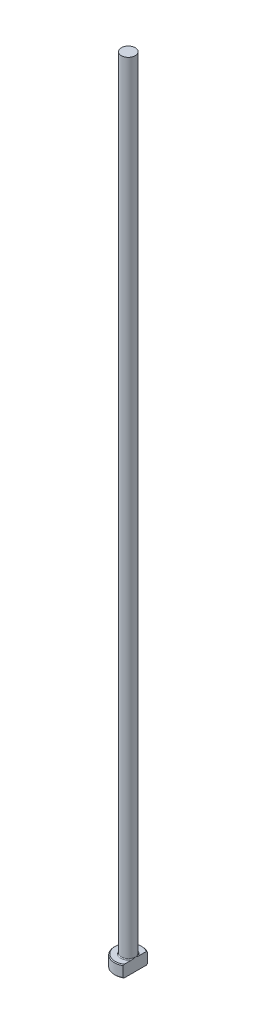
ISO-10303-21;
HEADER;
FILE_DESCRIPTION(('STEP AP214'),'2;1');
FILE_NAME('part.step','',(''),(''),'','','');
FILE_SCHEMA(('AUTOMOTIVE_DESIGN { 1 0 10303 214 1 1 1 1 }'));
ENDSEC;
DATA;
#1=APPLICATION_CONTEXT('core data for automotive mechanical design processes');
#2=APPLICATION_PROTOCOL_DEFINITION('international standard','automotive_design',2000,#1);
#3=PRODUCT_CONTEXT('',#1,'mechanical');
#4=PRODUCT('Part','Part','',(#3));
#5=PRODUCT_RELATED_PRODUCT_CATEGORY('part','',(#4));
#6=PRODUCT_DEFINITION_FORMATION('','',#4);
#7=PRODUCT_DEFINITION_CONTEXT('part definition',#1,'design');
#8=PRODUCT_DEFINITION('design','',#6,#7);
#9=PRODUCT_DEFINITION_SHAPE('','',#8);
#10=(LENGTH_UNIT() NAMED_UNIT(*) SI_UNIT(.MILLI.,.METRE.));
#11=(NAMED_UNIT(*) PLANE_ANGLE_UNIT() SI_UNIT($,.RADIAN.));
#12=(NAMED_UNIT(*) SI_UNIT($,.STERADIAN.) SOLID_ANGLE_UNIT());
#13=UNCERTAINTY_MEASURE_WITH_UNIT(LENGTH_MEASURE(1.E-05),#10,'distance_accuracy_value','');
#14=(GEOMETRIC_REPRESENTATION_CONTEXT(3) GLOBAL_UNCERTAINTY_ASSIGNED_CONTEXT((#13)) GLOBAL_UNIT_ASSIGNED_CONTEXT((#10,
#11,#12)) REPRESENTATION_CONTEXT('',''));
#15=CARTESIAN_POINT('',(0.,0.,0.));
#16=DIRECTION('',(0.,0.,1.));
#17=DIRECTION('',(1.,0.,0.));
#18=AXIS2_PLACEMENT_3D('',#15,#16,#17);
#19=CARTESIAN_POINT('',(0.,0.,0.));
#20=DIRECTION('',(0.,-1.,0.));
#21=DIRECTION('',(0.,0.,-1.));
#22=AXIS2_PLACEMENT_3D('',#19,#20,#21);
#23=PLANE('',#22);
#24=CARTESIAN_POINT('',(0.,0.,0.));
#25=DIRECTION('',(0.,-1.,0.));
#26=DIRECTION('',(0.,0.,-1.));
#27=AXIS2_PLACEMENT_3D('',#24,#25,#26);
#28=CIRCLE('',#27,3.29999999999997);
#29=CARTESIAN_POINT('',(1.74999999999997,0.,2.79776696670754));
#30=VERTEX_POINT('',#29);
#31=CARTESIAN_POINT('',(1.74999999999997,0.,-2.79776696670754));
#32=VERTEX_POINT('',#31);
#33=EDGE_CURVE('E98',#30,#32,#28,.T.);
#34=ORIENTED_EDGE('',*,*,#33,.T.);
#35=DIRECTION('',(0.,0.,1.));
#36=VECTOR('',#35,1.);
#37=CARTESIAN_POINT('',(1.74999999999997,0.,-3.03108891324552));
#38=LINE('',#37,#36);
#39=EDGE_CURVE('E83',#32,#30,#38,.T.);
#40=ORIENTED_EDGE('',*,*,#39,.T.);
#41=EDGE_LOOP('',(#34,#40));
#42=FACE_BOUND('',#41,.T.);
#43=ADVANCED_FACE('F32',(#42),#23,.T.);
#44=CARTESIAN_POINT('',(0.,259.958771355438,0.));
#45=DIRECTION('',(0.,1.,0.));
#46=DIRECTION('',(0.,0.,1.));
#47=AXIS2_PLACEMENT_3D('',#44,#45,#46);
#48=CYLINDRICAL_SURFACE('',#47,3.49999999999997);
#49=CARTESIAN_POINT('',(0.,2.80000000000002,0.));
#50=DIRECTION('',(0.,1.,0.));
#51=DIRECTION('',(0.,0.,1.));
#52=AXIS2_PLACEMENT_3D('',#49,#50,#51);
#53=CIRCLE('',#52,3.49999999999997);
#54=CARTESIAN_POINT('',(1.74999999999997,2.80000000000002,3.03108891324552));
#55=VERTEX_POINT('',#54);
#56=CARTESIAN_POINT('',(1.74999999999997,2.80000000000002,-3.03108891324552));
#57=VERTEX_POINT('',#56);
#58=EDGE_CURVE('E104',#55,#57,#53,.F.);
#59=ORIENTED_EDGE('',*,*,#58,.T.);
#60=DIRECTION('',(0.,-1.,0.));
#61=VECTOR('',#60,1.);
#62=CARTESIAN_POINT('',(1.74999999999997,200.,-3.03108891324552));
#63=LINE('',#62,#61);
#64=CARTESIAN_POINT('',(1.74999999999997,0.199999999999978,-3.03108891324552));
#65=VERTEX_POINT('',#64);
#66=EDGE_CURVE('E183',#57,#65,#63,.T.);
#67=ORIENTED_EDGE('',*,*,#66,.T.);
#68=CARTESIAN_POINT('',(0.,0.199999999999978,0.));
#69=DIRECTION('',(0.,-1.,0.));
#70=DIRECTION('',(0.,0.,-1.));
#71=AXIS2_PLACEMENT_3D('',#68,#69,#70);
#72=CIRCLE('',#71,3.49999999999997);
#73=CARTESIAN_POINT('',(1.74999999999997,0.199999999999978,3.03108891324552));
#74=VERTEX_POINT('',#73);
#75=EDGE_CURVE('E100',#65,#74,#72,.F.);
#76=ORIENTED_EDGE('',*,*,#75,.T.);
#77=DIRECTION('',(0.,-1.,0.));
#78=VECTOR('',#77,1.);
#79=CARTESIAN_POINT('',(1.74999999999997,200.,3.03108891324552));
#80=LINE('',#79,#78);
#81=EDGE_CURVE('E93',#55,#74,#80,.T.);
#82=ORIENTED_EDGE('',*,*,#81,.F.);
#83=EDGE_LOOP('',(#59,#67,#76,#82));
#84=FACE_BOUND('',#83,.T.);
#85=ADVANCED_FACE('F158',(#84),#48,.T.);
#86=CARTESIAN_POINT('',(-3.49999999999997,3.,0.));
#87=DIRECTION('',(0.,1.,0.));
#88=DIRECTION('',(0.,0.,1.));
#89=AXIS2_PLACEMENT_3D('',#86,#87,#88);
#90=PLANE('',#89);
#91=CARTESIAN_POINT('',(0.,3.,0.));
#92=DIRECTION('',(0.,1.,0.));
#93=DIRECTION('',(0.,0.,1.));
#94=AXIS2_PLACEMENT_3D('',#91,#92,#93);
#95=CIRCLE('',#94,3.29999999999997);
#96=CARTESIAN_POINT('',(1.74999999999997,3.,-2.79776696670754));
#97=VERTEX_POINT('',#96);
#98=CARTESIAN_POINT('',(1.74999999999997,3.,2.79776696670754));
#99=VERTEX_POINT('',#98);
#100=EDGE_CURVE('E178',#97,#99,#95,.T.);
#101=ORIENTED_EDGE('',*,*,#100,.T.);
#102=DIRECTION('',(0.,0.,-1.));
#103=VECTOR('',#102,1.);
#104=CARTESIAN_POINT('',(1.74999999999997,3.,0.));
#105=LINE('',#104,#103);
#106=CARTESIAN_POINT('',(1.74999999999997,2.99999999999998,0.860232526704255));
#107=VERTEX_POINT('',#106);
#108=EDGE_CURVE('E57',#99,#107,#105,.T.);
#109=ORIENTED_EDGE('',*,*,#108,.T.);
#110=CARTESIAN_POINT('',(0.,3.,0.));
#111=DIRECTION('',(0.,1.,0.));
#112=DIRECTION('',(0.,0.,1.));
#113=AXIS2_PLACEMENT_3D('',#110,#111,#112);
#114=CIRCLE('',#113,1.94999999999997);
#115=CARTESIAN_POINT('',(1.74999999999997,2.99999999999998,-0.860232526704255));
#116=VERTEX_POINT('',#115);
#117=EDGE_CURVE('E107',#107,#116,#114,.F.);
#118=ORIENTED_EDGE('',*,*,#117,.T.);
#119=EDGE_CURVE('E136',#116,#97,#105,.T.);
#120=ORIENTED_EDGE('',*,*,#119,.T.);
#121=EDGE_LOOP('',(#101,#109,#118,#120));
#122=FACE_BOUND('',#121,.T.);
#123=ADVANCED_FACE('F147',(#122),#90,.T.);
#124=CARTESIAN_POINT('',(0.,3.,0.));
#125=DIRECTION('',(0.,-1.,0.));
#126=DIRECTION('',(0.,0.,-1.));
#127=AXIS2_PLACEMENT_3D('',#124,#125,#126);
#128=CONICAL_SURFACE('',#127,3.29999999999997,0.785398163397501);
#129=ORIENTED_EDGE('',*,*,#58,.F.);
#130=CARTESIAN_POINT('',(1.74999999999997,-0.596308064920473,6.67057455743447));
#131=CARTESIAN_POINT('',(1.74999999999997,-0.450097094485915,6.51940719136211));
#132=CARTESIAN_POINT('',(1.74999999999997,-0.304043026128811,6.36808756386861));
#133=CARTESIAN_POINT('',(1.74999999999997,-0.0123415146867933,6.06505321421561));
#134=CARTESIAN_POINT('',(1.74999999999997,0.133305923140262,5.91333848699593));
#135=CARTESIAN_POINT('',(1.74999999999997,0.424172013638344,5.60934946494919));
#136=CARTESIAN_POINT('',(1.74999999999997,0.569390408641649,5.45707492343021));
#137=CARTESIAN_POINT('',(1.74999999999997,0.85918520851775,5.15191761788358));
#138=CARTESIAN_POINT('',(1.74999999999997,1.0037616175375,4.9990348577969));
#139=CARTESIAN_POINT('',(1.74999999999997,1.28922437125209,4.69552747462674));
#140=CARTESIAN_POINT('',(1.74999999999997,1.43012702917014,4.54491820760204));
#141=CARTESIAN_POINT('',(1.74999999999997,1.71087777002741,4.24272028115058));
#142=CARTESIAN_POINT('',(1.74999999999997,1.85072585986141,4.0911316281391));
#143=CARTESIAN_POINT('',(1.74999999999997,2.12895853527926,3.78667524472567));
#144=CARTESIAN_POINT('',(1.74999999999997,2.26734342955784,3.63380779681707));
#145=CARTESIAN_POINT('',(1.74999999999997,2.54209958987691,3.32627683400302));
#146=CARTESIAN_POINT('',(1.74999999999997,2.67847093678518,3.17161339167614));
#147=CARTESIAN_POINT('',(1.74999999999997,2.8961728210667,2.91990258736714));
#148=CARTESIAN_POINT('',(1.74999999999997,2.97843114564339,2.82365864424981));
#149=CARTESIAN_POINT('',(1.74999999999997,3.14148360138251,2.62991861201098));
#150=CARTESIAN_POINT('',(1.74999999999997,3.22227758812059,2.53242240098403));
#151=CARTESIAN_POINT('',(1.74999999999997,3.38274452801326,2.33479038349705));
#152=CARTESIAN_POINT('',(1.74999999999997,3.46239661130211,2.23463757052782));
#153=CARTESIAN_POINT('',(1.74999999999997,3.61891495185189,2.03220225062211));
#154=CARTESIAN_POINT('',(1.74999999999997,3.6957818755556,1.92992026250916));
#155=CARTESIAN_POINT('',(1.74999999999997,3.84669654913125,1.72090511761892));
#156=CARTESIAN_POINT('',(1.74999999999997,3.92068375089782,1.61412795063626));
#157=CARTESIAN_POINT('',(1.74999999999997,4.06269616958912,1.39638381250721));
#158=CARTESIAN_POINT('',(1.74999999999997,4.13071318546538,1.28541136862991));
#159=CARTESIAN_POINT('',(1.74999999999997,4.22516490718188,1.11561175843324));
#160=CARTESIAN_POINT('',(1.74999999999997,4.25522351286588,1.058816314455));
#161=CARTESIAN_POINT('',(1.74999999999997,4.31237042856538,0.943756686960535));
#162=CARTESIAN_POINT('',(1.74999999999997,4.33945819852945,0.885492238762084));
#163=CARTESIAN_POINT('',(1.74999999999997,4.41499290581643,0.708569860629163));
#164=CARTESIAN_POINT('',(1.74999999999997,4.45796078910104,0.587356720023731));
#165=CARTESIAN_POINT('',(1.74999999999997,4.50447230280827,0.405622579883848));
#166=CARTESIAN_POINT('',(1.74999999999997,4.51680920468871,0.347327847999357));
#167=CARTESIAN_POINT('',(1.74999999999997,4.53592536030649,0.229813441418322));
#168=CARTESIAN_POINT('',(1.74999999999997,4.54270510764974,0.170593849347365));
#169=CARTESIAN_POINT('',(1.74999999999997,4.55022681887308,0.051951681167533));
#170=CARTESIAN_POINT('',(1.74999999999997,4.55098747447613,-0.00746969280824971));
#171=CARTESIAN_POINT('',(1.74999999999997,4.5464654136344,-0.126082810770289));
#172=CARTESIAN_POINT('',(1.74999999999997,4.54118219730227,-0.18527453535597));
#173=CARTESIAN_POINT('',(1.74999999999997,4.52501178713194,-0.302357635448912));
#174=CARTESIAN_POINT('',(1.74999999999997,4.51417270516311,-0.360255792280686));
#175=CARTESIAN_POINT('',(1.74999999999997,4.48756668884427,-0.474896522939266));
#176=CARTESIAN_POINT('',(1.74999999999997,4.47179916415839,-0.531638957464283));
#177=CARTESIAN_POINT('',(1.74999999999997,4.43599695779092,-0.64410319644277));
#178=CARTESIAN_POINT('',(1.74999999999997,4.41593824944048,-0.699817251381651));
#179=CARTESIAN_POINT('',(1.74999999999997,4.37235913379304,-0.809843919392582));
#180=CARTESIAN_POINT('',(1.74999999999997,4.348839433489,-0.864156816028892));
#181=CARTESIAN_POINT('',(1.74999999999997,4.27385837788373,-1.0256237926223));
#182=CARTESIAN_POINT('',(1.74999999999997,4.21814894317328,-1.13079943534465));
#183=CARTESIAN_POINT('',(1.74999999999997,4.09935726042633,-1.33694307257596));
#184=CARTESIAN_POINT('',(1.74999999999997,4.03626572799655,-1.43790554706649));
#185=CARTESIAN_POINT('',(1.74999999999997,3.90490246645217,-1.63694628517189));
#186=CARTESIAN_POINT('',(1.74999999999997,3.83661129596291,-1.73501160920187));
#187=CARTESIAN_POINT('',(1.74999999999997,3.69663576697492,-1.92859117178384));
#188=CARTESIAN_POINT('',(1.74999999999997,3.62495312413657,-2.02410666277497));
#189=CARTESIAN_POINT('',(1.74999999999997,3.47817312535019,-2.21448054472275));
#190=CARTESIAN_POINT('',(1.74999999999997,3.4030432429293,-2.30931373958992));
#191=CARTESIAN_POINT('',(1.74999999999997,3.25092223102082,-2.49748629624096));
#192=CARTESIAN_POINT('',(1.74999999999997,3.17393090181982,-2.59082549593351));
#193=CARTESIAN_POINT('',(1.74999999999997,3.01873588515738,-2.77610276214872));
#194=CARTESIAN_POINT('',(1.74999999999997,2.94053559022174,-2.8680436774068));
#195=CARTESIAN_POINT('',(1.74999999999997,2.78305359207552,-3.05099558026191));
#196=CARTESIAN_POINT('',(1.74999999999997,2.70377186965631,-3.14200655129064));
#197=CARTESIAN_POINT('',(1.74999999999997,2.4917775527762,-3.38307713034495));
#198=CARTESIAN_POINT('',(1.74999999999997,2.3583209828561,-3.53248201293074));
#199=CARTESIAN_POINT('',(1.74999999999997,2.08977689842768,-3.82982116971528));
#200=CARTESIAN_POINT('',(1.74999999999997,1.95468933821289,-3.97775540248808));
#201=CARTESIAN_POINT('',(1.74999999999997,1.68319766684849,-4.27266697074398));
#202=CARTESIAN_POINT('',(1.74999999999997,1.5467924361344,-4.41964327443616));
#203=CARTESIAN_POINT('',(1.74999999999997,1.27308598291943,-4.71275937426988));
#204=CARTESIAN_POINT('',(1.74999999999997,1.13578475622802,-4.85889916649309));
#205=CARTESIAN_POINT('',(1.74999999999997,0.734183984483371,-5.28435414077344));
#206=CARTESIAN_POINT('',(1.74999999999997,0.468971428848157,-5.56280727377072));
#207=CARTESIAN_POINT('',(1.74999999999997,0.0701049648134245,-5.97918348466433));
#208=CARTESIAN_POINT('',(1.74999999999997,-0.0629507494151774,-6.11768155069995));
#209=CARTESIAN_POINT('',(1.74999999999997,-0.329395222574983,-6.39435480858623));
#210=CARTESIAN_POINT('',(1.74999999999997,-0.462783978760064,-6.53253000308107));
#211=CARTESIAN_POINT('',(1.74999999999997,-0.596308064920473,-6.67057455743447));
#212=B_SPLINE_CURVE_WITH_KNOTS('',3,(#130,#131,#132,#133,#134,#135,#136,#137,#138,#139,#140,
#141,#142,#143,#144,#145,#146,#147,#148,#149,#150,#151,#152,#153,#154,#155,#156,#157,#158,#159,
#160,#161,#162,#163,#164,#165,#166,#167,#168,#169,#170,#171,#172,#173,#174,#175,#176,#177,#178,
#179,#180,#181,#182,#183,#184,#185,#186,#187,#188,#189,#190,#191,#192,#193,#194,#195,#196,#197,
#198,#199,#200,#201,#202,#203,#204,#205,#206,#207,#208,#209,#210,#211),.UNSPECIFIED.,.F.,.F.,(4,
2,2,2,2,2,2,2,2,2,2,2,2,2,2,2,2,2,2,2,2,2,2,2,2,2,2,2,2,2,2,2,2,2,2,2,2,2,2,2,4),(0.,
0.630922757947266,1.26185363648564,1.89310749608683,2.52435727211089,3.14308654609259,
3.76181177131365,4.38040374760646,4.9989708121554,5.37878108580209,5.7586286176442,
6.14249031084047,6.52625953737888,6.91585739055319,7.30598230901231,7.49867618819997,
7.69140503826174,8.07538783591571,8.25392686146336,8.43245002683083,8.61041858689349,
8.78840186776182,8.96486927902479,9.14135783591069,9.31886171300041,9.49632938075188,
9.85286274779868,10.2098494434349,10.5682434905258,10.9264581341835,11.2893876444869,
11.6523562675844,12.0144447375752,12.3765396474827,12.9775131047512,13.5785034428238,
14.1800594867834,14.7816183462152,15.9352370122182,16.51140505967,17.0875683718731),.UNSPECIFIED.);
#213=EDGE_CURVE('E135',#55,#99,#212,.T.);
#214=ORIENTED_EDGE('',*,*,#213,.T.);
#215=ORIENTED_EDGE('',*,*,#100,.F.);
#216=EDGE_CURVE('E127',#97,#57,#212,.T.);
#217=ORIENTED_EDGE('',*,*,#216,.T.);
#218=EDGE_LOOP('',(#129,#214,#215,#217));
#219=FACE_BOUND('',#218,.T.);
#220=ADVANCED_FACE('F143',(#219),#128,.T.);
#221=CARTESIAN_POINT('',(0.,0.199999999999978,0.));
#222=DIRECTION('',(0.,1.,0.));
#223=DIRECTION('',(0.,0.,1.));
#224=AXIS2_PLACEMENT_3D('',#221,#222,#223);
#225=CONICAL_SURFACE('',#224,3.49999999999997,0.785398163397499);
#226=ORIENTED_EDGE('',*,*,#75,.F.);
#227=CARTESIAN_POINT('',(1.74999999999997,3.59630806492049,-6.67057455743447));
#228=CARTESIAN_POINT('',(1.74999999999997,3.45009709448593,-6.51940719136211));
#229=CARTESIAN_POINT('',(1.74999999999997,3.30404302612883,-6.36808756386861));
#230=CARTESIAN_POINT('',(1.74999999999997,3.01234151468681,-6.0650532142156));
#231=CARTESIAN_POINT('',(1.74999999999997,2.86669407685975,-5.91333848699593));
#232=CARTESIAN_POINT('',(1.74999999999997,2.57582798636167,-5.60934946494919));
#233=CARTESIAN_POINT('',(1.74999999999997,2.43060959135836,-5.45707492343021));
#234=CARTESIAN_POINT('',(1.74999999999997,2.14081479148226,-5.15191761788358));
#235=CARTESIAN_POINT('',(1.74999999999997,1.99623838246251,-4.9990348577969));
#236=CARTESIAN_POINT('',(1.74999999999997,1.71077562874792,-4.69552747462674));
#237=CARTESIAN_POINT('',(1.74999999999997,1.56987297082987,-4.54491820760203));
#238=CARTESIAN_POINT('',(1.74999999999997,1.28912222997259,-4.24272028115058));
#239=CARTESIAN_POINT('',(1.74999999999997,1.1492741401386,-4.0911316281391));
#240=CARTESIAN_POINT('',(1.74999999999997,0.871041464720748,-3.78667524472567));
#241=CARTESIAN_POINT('',(1.74999999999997,0.732656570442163,-3.63380779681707));
#242=CARTESIAN_POINT('',(1.74999999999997,0.457900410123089,-3.32627683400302));
#243=CARTESIAN_POINT('',(1.74999999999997,0.321529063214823,-3.17161339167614));
#244=CARTESIAN_POINT('',(1.74999999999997,0.103827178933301,-2.91990258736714));
#245=CARTESIAN_POINT('',(1.74999999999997,0.0215688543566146,-2.82365864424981));
#246=CARTESIAN_POINT('',(1.74999999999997,-0.141483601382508,-2.62991861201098));
#247=CARTESIAN_POINT('',(1.74999999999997,-0.222277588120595,-2.53242240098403));
#248=CARTESIAN_POINT('',(1.74999999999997,-0.382744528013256,-2.33479038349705));
#249=CARTESIAN_POINT('',(1.74999999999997,-0.462396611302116,-2.23463757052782));
#250=CARTESIAN_POINT('',(1.74999999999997,-0.618914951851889,-2.03220225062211));
#251=CARTESIAN_POINT('',(1.74999999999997,-0.695781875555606,-1.92992026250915));
#252=CARTESIAN_POINT('',(1.74999999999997,-0.84669654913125,-1.72090511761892));
#253=CARTESIAN_POINT('',(1.74999999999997,-0.920683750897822,-1.61412795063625));
#254=CARTESIAN_POINT('',(1.74999999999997,-1.06269616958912,-1.39638381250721));
#255=CARTESIAN_POINT('',(1.74999999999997,-1.13071318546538,-1.28541136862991));
#256=CARTESIAN_POINT('',(1.74999999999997,-1.22516490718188,-1.11561175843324));
#257=CARTESIAN_POINT('',(1.74999999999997,-1.25522351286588,-1.058816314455));
#258=CARTESIAN_POINT('',(1.74999999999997,-1.31237042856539,-0.943756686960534));
#259=CARTESIAN_POINT('',(1.74999999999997,-1.33945819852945,-0.885492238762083));
#260=CARTESIAN_POINT('',(1.74999999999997,-1.41499290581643,-0.708569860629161));
#261=CARTESIAN_POINT('',(1.74999999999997,-1.45796078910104,-0.58735672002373));
#262=CARTESIAN_POINT('',(1.74999999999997,-1.50447230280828,-0.405622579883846));
#263=CARTESIAN_POINT('',(1.74999999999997,-1.51680920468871,-0.347327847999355));
#264=CARTESIAN_POINT('',(1.74999999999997,-1.53592536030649,-0.229813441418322));
#265=CARTESIAN_POINT('',(1.74999999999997,-1.54270510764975,-0.170593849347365));
#266=CARTESIAN_POINT('',(1.74999999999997,-1.55022681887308,-0.0519516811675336));
#267=CARTESIAN_POINT('',(1.74999999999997,-1.55098747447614,0.00746969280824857));
#268=CARTESIAN_POINT('',(1.74999999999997,-1.54646541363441,0.126082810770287));
#269=CARTESIAN_POINT('',(1.74999999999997,-1.54118219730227,0.185274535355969));
#270=CARTESIAN_POINT('',(1.74999999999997,-1.52501178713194,0.30235763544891));
#271=CARTESIAN_POINT('',(1.74999999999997,-1.51417270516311,0.360255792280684));
#272=CARTESIAN_POINT('',(1.74999999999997,-1.48756668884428,0.474896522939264));
#273=CARTESIAN_POINT('',(1.74999999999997,-1.4717991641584,0.531638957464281));
#274=CARTESIAN_POINT('',(1.74999999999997,-1.43599695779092,0.644103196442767));
#275=CARTESIAN_POINT('',(1.74999999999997,-1.41593824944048,0.699817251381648));
#276=CARTESIAN_POINT('',(1.74999999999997,-1.37235913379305,0.809843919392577));
#277=CARTESIAN_POINT('',(1.74999999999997,-1.348839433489,0.864156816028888));
#278=CARTESIAN_POINT('',(1.74999999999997,-1.27385837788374,1.0256237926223));
#279=CARTESIAN_POINT('',(1.74999999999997,-1.21814894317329,1.13079943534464));
#280=CARTESIAN_POINT('',(1.74999999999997,-1.09935726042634,1.33694307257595));
#281=CARTESIAN_POINT('',(1.74999999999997,-1.03626572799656,1.43790554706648));
#282=CARTESIAN_POINT('',(1.74999999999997,-0.904902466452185,1.63694628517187));
#283=CARTESIAN_POINT('',(1.74999999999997,-0.836611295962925,1.73501160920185));
#284=CARTESIAN_POINT('',(1.74999999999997,-0.696635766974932,1.92859117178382));
#285=CARTESIAN_POINT('',(1.74999999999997,-0.624953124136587,2.02410666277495));
#286=CARTESIAN_POINT('',(1.74999999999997,-0.478173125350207,2.21448054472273));
#287=CARTESIAN_POINT('',(1.74999999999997,-0.403043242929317,2.3093137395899));
#288=CARTESIAN_POINT('',(1.74999999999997,-0.250922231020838,2.49748629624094));
#289=CARTESIAN_POINT('',(1.74999999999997,-0.173930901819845,2.59082549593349));
#290=CARTESIAN_POINT('',(1.74999999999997,-0.0187358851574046,2.7761027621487));
#291=CARTESIAN_POINT('',(1.74999999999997,0.0594644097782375,2.86804367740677));
#292=CARTESIAN_POINT('',(1.74999999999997,0.216946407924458,3.05099558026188));
#293=CARTESIAN_POINT('',(1.74999999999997,0.296228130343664,3.14200655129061));
#294=CARTESIAN_POINT('',(1.74999999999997,0.508222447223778,3.38307713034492));
#295=CARTESIAN_POINT('',(1.74999999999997,0.641679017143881,3.53248201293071));
#296=CARTESIAN_POINT('',(1.74999999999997,0.910223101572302,3.82982116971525));
#297=CARTESIAN_POINT('',(1.74999999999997,1.04531066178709,3.97775540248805));
#298=CARTESIAN_POINT('',(1.74999999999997,1.3168023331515,4.27266697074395));
#299=CARTESIAN_POINT('',(1.74999999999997,1.45320756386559,4.41964327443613));
#300=CARTESIAN_POINT('',(1.74999999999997,1.72691401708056,4.71275937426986));
#301=CARTESIAN_POINT('',(1.74999999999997,1.86421524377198,4.85889916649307));
#302=CARTESIAN_POINT('',(1.74999999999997,2.26581601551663,5.28435414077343));
#303=CARTESIAN_POINT('',(1.74999999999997,2.53102857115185,5.56280727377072));
#304=CARTESIAN_POINT('',(1.74999999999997,2.92989503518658,5.97918348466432));
#305=CARTESIAN_POINT('',(1.74999999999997,3.06295074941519,6.11768155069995));
#306=CARTESIAN_POINT('',(1.74999999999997,3.329395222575,6.39435480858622));
#307=CARTESIAN_POINT('',(1.74999999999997,3.46278397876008,6.53253000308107));
#308=CARTESIAN_POINT('',(1.74999999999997,3.59630806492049,6.67057455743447));
#309=B_SPLINE_CURVE_WITH_KNOTS('',3,(#227,#228,#229,#230,#231,#232,#233,#234,#235,#236,#237,
#238,#239,#240,#241,#242,#243,#244,#245,#246,#247,#248,#249,#250,#251,#252,#253,#254,#255,#256,
#257,#258,#259,#260,#261,#262,#263,#264,#265,#266,#267,#268,#269,#270,#271,#272,#273,#274,#275,
#276,#277,#278,#279,#280,#281,#282,#283,#284,#285,#286,#287,#288,#289,#290,#291,#292,#293,#294,
#295,#296,#297,#298,#299,#300,#301,#302,#303,#304,#305,#306,#307,#308),.UNSPECIFIED.,.F.,.F.,(4,
2,2,2,2,2,2,2,2,2,2,2,2,2,2,2,2,2,2,2,2,2,2,2,2,2,2,2,2,2,2,2,2,2,2,2,2,2,2,2,4),(0.,
0.630922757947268,1.26185363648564,1.89310749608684,2.52435727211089,3.1430865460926,
3.76181177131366,4.38040374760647,4.99897081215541,5.37878108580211,5.75862861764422,
6.14249031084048,6.52625953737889,6.9158573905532,7.30598230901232,7.49867618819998,
7.69140503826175,8.07538783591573,8.25392686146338,8.43245002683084,8.6104185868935,
8.78840186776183,8.9648692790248,9.14135783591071,9.31886171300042,9.49632938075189,
9.85286274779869,10.2098494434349,10.5682434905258,10.9264581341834,11.2893876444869,
11.6523562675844,12.0144447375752,12.3765396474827,12.9775131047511,13.5785034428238,
14.1800594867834,14.7816183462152,15.9352370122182,16.51140505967,17.0875683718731),.UNSPECIFIED.);
#310=EDGE_CURVE('E86',#65,#32,#309,.T.);
#311=ORIENTED_EDGE('',*,*,#310,.T.);
#312=ORIENTED_EDGE('',*,*,#33,.F.);
#313=EDGE_CURVE('E89',#30,#74,#309,.T.);
#314=ORIENTED_EDGE('',*,*,#313,.T.);
#315=EDGE_LOOP('',(#226,#311,#312,#314));
#316=FACE_BOUND('',#315,.T.);
#317=ADVANCED_FACE('F97',(#316),#225,.T.);
#318=CARTESIAN_POINT('',(0.,3.19999999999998,0.));
#319=DIRECTION('',(0.,1.,0.));
#320=DIRECTION('',(0.,0.,1.));
#321=AXIS2_PLACEMENT_3D('',#318,#319,#320);
#322=TOROIDAL_SURFACE('',#321,1.94999999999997,0.2);
#323=CARTESIAN_POINT('',(1.74999999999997,3.19999999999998,0.));
#324=CARTESIAN_POINT('',(1.74999999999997,3.20000050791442,9.38679694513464E-11));
#325=CARTESIAN_POINT('',(1.74999999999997,3.20000101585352,-1.34501098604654E-07));
#326=CARTESIAN_POINT('',(1.74999999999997,3.20000198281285,-5.41283468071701E-07));
#327=CARTESIAN_POINT('',(1.74999999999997,3.20000243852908,-8.19487700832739E-07));
#328=CARTESIAN_POINT('',(1.74999999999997,3.20000335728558,-1.4843911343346E-06));
#329=CARTESIAN_POINT('',(1.74999999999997,3.20000381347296,-1.88052630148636E-06));
#330=CARTESIAN_POINT('',(1.74999999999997,3.20000466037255,-2.72280863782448E-06));
#331=CARTESIAN_POINT('',(1.74999999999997,3.20000505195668,-3.16812551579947E-06));
#332=CARTESIAN_POINT('',(1.74999999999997,3.20000641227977,-4.80772278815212E-06));
#333=CARTESIAN_POINT('',(1.74999999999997,3.20000730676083,-6.06508167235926E-06));
#334=CARTESIAN_POINT('',(1.74999999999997,3.20000885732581,-8.62364306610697E-06));
#335=CARTESIAN_POINT('',(1.74999999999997,3.20000952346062,-9.91907764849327E-06));
#336=CARTESIAN_POINT('',(1.74999999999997,3.20001212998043,-1.51310765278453E-05));
#337=CARTESIAN_POINT('',(1.74999999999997,3.20001395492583,-1.91092654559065E-05));
#338=CARTESIAN_POINT('',(1.74999999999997,3.2000168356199,-2.68327805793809E-05));
#339=CARTESIAN_POINT('',(1.74999999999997,3.20001795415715,-3.05551299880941E-05));
#340=CARTESIAN_POINT('',(1.74999999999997,3.20002287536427,-4.68261372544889E-05));
#341=CARTESIAN_POINT('',(1.74999999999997,3.20002674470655,-5.93446276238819E-05));
#342=CARTESIAN_POINT('',(1.74999999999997,3.20003278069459,-8.25255939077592E-05));
#343=CARTESIAN_POINT('',(1.74999999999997,3.20003512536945,-9.31393220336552E-05));
#344=CARTESIAN_POINT('',(1.74999999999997,3.20005413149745,-0.00017197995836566));
#345=CARTESIAN_POINT('',(1.74999999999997,3.20007897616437,-0.000237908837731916));
#346=CARTESIAN_POINT('',(1.74999999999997,3.20017305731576,-0.000496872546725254));
#347=CARTESIAN_POINT('',(1.74999999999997,3.20023617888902,-0.00069150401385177));
#348=CARTESIAN_POINT('',(1.74999999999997,3.20048774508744,-0.00145613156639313));
#349=CARTESIAN_POINT('',(1.74999999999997,3.20068259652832,-0.00202450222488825));
#350=CARTESIAN_POINT('',(1.74999999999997,3.20148279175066,-0.0043694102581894));
#351=CARTESIAN_POINT('',(1.74999999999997,3.20208089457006,-0.00614773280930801));
#352=CARTESIAN_POINT('',(1.74999999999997,3.20853845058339,-0.0253339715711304));
#353=CARTESIAN_POINT('',(1.74999999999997,3.21443574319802,-0.0427328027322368));
#354=CARTESIAN_POINT('',(1.74999999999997,3.22594434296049,-0.0768841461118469));
#355=CARTESIAN_POINT('',(1.74999999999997,3.2315579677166,-0.0936359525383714));
#356=CARTESIAN_POINT('',(1.74999999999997,3.24339960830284,-0.129193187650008));
#357=CARTESIAN_POINT('',(1.74999999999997,3.24961959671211,-0.148001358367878));
#358=CARTESIAN_POINT('',(1.74999999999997,3.26199268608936,-0.185858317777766));
#359=CARTESIAN_POINT('',(1.74999999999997,3.26814439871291,-0.204907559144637));
#360=CARTESIAN_POINT('',(1.74999999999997,3.28302129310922,-0.251728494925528));
#361=CARTESIAN_POINT('',(1.74999999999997,3.29164632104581,-0.279532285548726));
#362=CARTESIAN_POINT('',(1.74999999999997,3.30815507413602,-0.334622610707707));
#363=CARTESIAN_POINT('',(1.74999999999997,3.31605173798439,-0.361905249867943));
#364=CARTESIAN_POINT('',(1.74999999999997,3.33270110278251,-0.422187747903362));
#365=CARTESIAN_POINT('',(1.74999999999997,3.34130455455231,-0.4552293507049));
#366=CARTESIAN_POINT('',(1.74999999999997,3.35728256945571,-0.521873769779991));
#367=CARTESIAN_POINT('',(1.74999999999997,3.36464748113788,-0.555478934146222));
#368=CARTESIAN_POINT('',(1.74999999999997,3.37810121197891,-0.62522543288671));
#369=CARTESIAN_POINT('',(1.74999999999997,3.38407559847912,-0.661389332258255));
#370=CARTESIAN_POINT('',(1.74999999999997,3.39348021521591,-0.733973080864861));
#371=CARTESIAN_POINT('',(1.74999999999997,3.39691695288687,-0.770392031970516));
#372=CARTESIAN_POINT('',(1.74999999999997,3.39990626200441,-0.832262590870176));
#373=CARTESIAN_POINT('',(1.74999999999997,3.40032395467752,-0.85767040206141));
#374=CARTESIAN_POINT('',(1.74999999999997,3.39916217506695,-0.908260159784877));
#375=CARTESIAN_POINT('',(1.74999999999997,3.39759783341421,-0.933442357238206));
#376=CARTESIAN_POINT('',(1.74999999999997,3.39129859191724,-0.989903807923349));
#377=CARTESIAN_POINT('',(1.74999999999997,3.38586007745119,-1.02110925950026));
#378=CARTESIAN_POINT('',(1.74999999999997,3.36964168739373,-1.08216800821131));
#379=CARTESIAN_POINT('',(1.74999999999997,3.35888918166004,-1.11202738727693));
#380=CARTESIAN_POINT('',(1.74999999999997,3.33961802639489,-1.14878048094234));
#381=CARTESIAN_POINT('',(1.74999999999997,3.33455492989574,-1.15748014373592));
#382=CARTESIAN_POINT('',(1.74999999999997,3.32351587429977,-1.1742966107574));
#383=CARTESIAN_POINT('',(1.74999999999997,3.31753946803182,-1.18241312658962));
#384=CARTESIAN_POINT('',(1.74999999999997,3.30451428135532,-1.19787793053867));
#385=CARTESIAN_POINT('',(1.74999999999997,3.29745609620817,-1.20521842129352));
#386=CARTESIAN_POINT('',(1.74999999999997,3.2822352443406,-1.21865698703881));
#387=CARTESIAN_POINT('',(1.74999999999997,3.27407476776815,-1.22475746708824));
#388=CARTESIAN_POINT('',(1.74999999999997,3.25920166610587,-1.23370537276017));
#389=CARTESIAN_POINT('',(1.74999999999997,3.25274944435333,-1.23698363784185));
#390=CARTESIAN_POINT('',(1.74999999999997,3.23939659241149,-1.24245066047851));
#391=CARTESIAN_POINT('',(1.74999999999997,3.23249637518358,-1.2446404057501));
#392=CARTESIAN_POINT('',(1.74999999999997,3.21836445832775,-1.24776583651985));
#393=CARTESIAN_POINT('',(1.74999999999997,3.21113087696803,-1.24869317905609));
#394=CARTESIAN_POINT('',(1.74999999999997,3.19661788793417,-1.24917680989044));
#395=CARTESIAN_POINT('',(1.74999999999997,3.18933848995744,-1.2487333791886));
#396=CARTESIAN_POINT('',(1.74999999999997,3.17564813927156,-1.2466228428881));
#397=CARTESIAN_POINT('',(1.74999999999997,3.16921873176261,-1.24507159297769));
#398=CARTESIAN_POINT('',(1.74999999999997,3.1566813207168,-1.24099086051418));
#399=CARTESIAN_POINT('',(1.74999999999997,3.15057343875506,-1.23846101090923));
#400=CARTESIAN_POINT('',(1.74999999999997,3.13656990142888,-1.23147130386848));
#401=CARTESIAN_POINT('',(1.74999999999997,3.1288582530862,-1.2266435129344));
#402=CARTESIAN_POINT('',(1.74999999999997,3.11430996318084,-1.21581214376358));
#403=CARTESIAN_POINT('',(1.74999999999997,3.10747539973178,-1.20980585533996));
#404=CARTESIAN_POINT('',(1.74999999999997,3.09141283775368,-1.19367262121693));
#405=CARTESIAN_POINT('',(1.74999999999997,3.0827335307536,-1.18300273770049));
#406=CARTESIAN_POINT('',(1.74999999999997,3.06710756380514,-1.16049397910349));
#407=CARTESIAN_POINT('',(1.74999999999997,3.06016260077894,-1.14865397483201));
#408=CARTESIAN_POINT('',(1.74999999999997,3.04314403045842,-1.11526045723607));
#409=CARTESIAN_POINT('',(1.74999999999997,3.03452872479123,-1.09297031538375));
#410=CARTESIAN_POINT('',(1.74999999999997,3.0205187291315,-1.04724849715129));
#411=CARTESIAN_POINT('',(1.74999999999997,3.01515578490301,-1.02380790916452));
#412=CARTESIAN_POINT('',(1.74999999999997,3.00698483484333,-0.976403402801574));
#413=CARTESIAN_POINT('',(1.74999999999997,3.00418732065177,-0.952437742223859));
#414=CARTESIAN_POINT('',(1.74999999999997,3.00064912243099,-0.9043219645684));
#415=CARTESIAN_POINT('',(1.74999999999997,2.99991269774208,-0.880171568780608));
#416=CARTESIAN_POINT('',(1.74999999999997,3.00019275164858,-0.809643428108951));
#417=CARTESIAN_POINT('',(1.74999999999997,3.00344813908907,-0.763278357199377));
#418=CARTESIAN_POINT('',(1.74999999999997,3.01492484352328,-0.664825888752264));
#419=CARTESIAN_POINT('',(1.74999999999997,3.02376250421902,-0.612819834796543));
#420=CARTESIAN_POINT('',(1.74999999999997,3.04538488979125,-0.508370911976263));
#421=CARTESIAN_POINT('',(1.74999999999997,3.0582587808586,-0.455947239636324));
#422=CARTESIAN_POINT('',(1.74999999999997,3.08196429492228,-0.368604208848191));
#423=CARTESIAN_POINT('',(1.74999999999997,3.09211504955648,-0.333493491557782));
#424=CARTESIAN_POINT('',(1.74999999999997,3.11312724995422,-0.263893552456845));
#425=CARTESIAN_POINT('',(1.74999999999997,3.12397997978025,-0.229401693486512));
#426=CARTESIAN_POINT('',(1.74999999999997,3.1449667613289,-0.164340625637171));
#427=CARTESIAN_POINT('',(1.74999999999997,3.15504975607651,-0.133754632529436));
#428=CARTESIAN_POINT('',(1.74999999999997,3.17587821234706,-0.071424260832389));
#429=CARTESIAN_POINT('',(1.74999999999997,3.18663395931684,-0.0396831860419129));
#430=CARTESIAN_POINT('',(1.74999999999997,3.19791979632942,-0.0061453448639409));
#431=CARTESIAN_POINT('',(1.74999999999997,3.1985187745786,-0.00436467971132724));
#432=CARTESIAN_POINT('',(1.74999999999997,3.19931918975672,-0.00201922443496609));
#433=CARTESIAN_POINT('',(1.74999999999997,3.1995134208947,-0.00145265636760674));
#434=CARTESIAN_POINT('',(1.74999999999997,3.19976423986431,-0.000690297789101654));
#435=CARTESIAN_POINT('',(1.74999999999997,3.19982721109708,-0.000496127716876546));
#436=CARTESIAN_POINT('',(1.74999999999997,3.19992109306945,-0.000237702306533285));
#437=CARTESIAN_POINT('',(1.74999999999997,3.19994590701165,-0.000171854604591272));
#438=CARTESIAN_POINT('',(1.74999999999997,3.19996489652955,-9.31045536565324E-05));
#439=CARTESIAN_POINT('',(1.74999999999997,3.19996724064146,-8.24963335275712E-05));
#440=CARTESIAN_POINT('',(1.74999999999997,3.19997327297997,-5.93277760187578E-05));
#441=CARTESIAN_POINT('',(1.74999999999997,3.1999771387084,-4.68160427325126E-05));
#442=CARTESIAN_POINT('',(1.74999999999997,3.19998205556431,-3.05525841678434E-05));
#443=CARTESIAN_POINT('',(1.74999999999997,3.19998317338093,-2.68310310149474E-05));
#444=CARTESIAN_POINT('',(1.74999999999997,3.19998605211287,-1.91090650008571E-05));
#445=CARTESIAN_POINT('',(1.74999999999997,3.19998787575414,-1.51315953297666E-05));
#446=CARTESIAN_POINT('',(1.74999999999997,3.19999048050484,-9.92029969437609E-06));
#447=CARTESIAN_POINT('',(1.74999999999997,3.19999114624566,-8.62492588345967E-06));
#448=CARTESIAN_POINT('',(1.74999999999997,3.19999269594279,-6.06641152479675E-06));
#449=CARTESIAN_POINT('',(1.74999999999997,3.19999358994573,-4.80903333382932E-06));
#450=CARTESIAN_POINT('',(1.74999999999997,3.19999494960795,-3.16932189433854E-06));
#451=CARTESIAN_POINT('',(1.74999999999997,3.19999534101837,-2.72395382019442E-06));
#452=CARTESIAN_POINT('',(1.74999999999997,3.19999618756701,-1.88153780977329E-06));
#453=CARTESIAN_POINT('',(1.74999999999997,3.19999664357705,-1.48531958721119E-06));
#454=CARTESIAN_POINT('',(1.74999999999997,3.1999975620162,-8.20216861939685E-07));
#455=CARTESIAN_POINT('',(1.74999999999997,3.19999801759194,-5.41901808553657E-07));
#456=CARTESIAN_POINT('',(1.74999999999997,3.19999898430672,-1.34847126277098E-07));
#457=CARTESIAN_POINT('',(1.74999999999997,3.19999949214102,-9.38577158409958E-11));
#458=CARTESIAN_POINT('',(1.74999999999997,3.19999999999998,0.));
#459=B_SPLINE_CURVE_WITH_KNOTS('',3,(#323,#324,#325,#326,#327,#328,#329,#330,#331,#332,#333,
#334,#335,#336,#337,#338,#339,#340,#341,#342,#343,#344,#345,#346,#347,#348,#349,#350,#351,#352,
#353,#354,#355,#356,#357,#358,#359,#360,#361,#362,#363,#364,#365,#366,#367,#368,#369,#370,#371,
#372,#373,#374,#375,#376,#377,#378,#379,#380,#381,#382,#383,#384,#385,#386,#387,#388,#389,#390,
#391,#392,#393,#394,#395,#396,#397,#398,#399,#400,#401,#402,#403,#404,#405,#406,#407,#408,#409,
#410,#411,#412,#413,#414,#415,#416,#417,#418,#419,#420,#421,#422,#423,#424,#425,#426,#427,#428,
#429,#430,#431,#432,#433,#434,#435,#436,#437,#438,#439,#440,#441,#442,#443,#444,#445,#446,#447,
#448,#449,#450,#451,#452,#453,#454,#455,#456,#457,#458),.UNSPECIFIED.,.T.,.F.,(4,2,2,2,2,2,2,2,
2,2,2,2,2,2,2,2,2,2,2,2,2,2,2,2,2,2,2,2,2,2,2,2,2,2,2,2,2,2,2,2,2,2,2,2,2,2,2,2,2,2,2,2,2,2,2,2,
2,2,2,2,2,2,2,2,2,2,2,4),(0.,1.52538207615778E-06,3.12059533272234E-06,4.92466458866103E-06,
6.70193593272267E-06,1.13103009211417E-05,1.56767125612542E-05,2.8774065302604E-05,
4.0421459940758E-05,7.97265134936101E-05,0.00011230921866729,0.000323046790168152,
0.000937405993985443,0.0027392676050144,0.00836862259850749,0.0634773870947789,
0.116480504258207,0.175909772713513,0.235963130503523,0.32329152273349,0.408492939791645,
0.510903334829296,0.614078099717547,0.723976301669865,0.833591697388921,0.909765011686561,
0.985360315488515,1.08013194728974,1.1744204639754,1.20457287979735,1.23474010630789,
1.26518627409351,1.29557281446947,1.3172031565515,1.33881383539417,1.36056665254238,
1.38231501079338,1.40207044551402,1.42183329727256,1.44897527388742,1.47618041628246,
1.51721056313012,1.55828069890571,1.62957223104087,1.70154887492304,1.77381858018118,
1.84623752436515,1.98535010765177,2.1434225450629,2.30526751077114,2.41490365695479,
2.52337268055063,2.61998889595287,2.72052170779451,2.72615854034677,2.72795468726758,
2.72856758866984,2.72877806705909,2.72881063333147,2.72884991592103,2.7288615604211,
2.72887465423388,2.72887901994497,2.72888362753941,2.72888540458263,2.72888720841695,
2.72888880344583,2.72889032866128),.UNSPECIFIED.);
#460=CARTESIAN_POINT('',(1.74999999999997,3.19999999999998,0.));
#461=VERTEX_POINT('',#460);
#462=EDGE_CURVE('E11',#116,#461,#459,.T.);
#463=ORIENTED_EDGE('',*,*,#462,.F.);
#464=ORIENTED_EDGE('',*,*,#117,.F.);
#465=CARTESIAN_POINT('',(1.74999999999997,3.19999999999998,0.));
#466=CARTESIAN_POINT('',(1.74999999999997,3.19999949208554,-9.38679203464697E-11));
#467=CARTESIAN_POINT('',(1.74999999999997,3.19999898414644,1.34501098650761E-07));
#468=CARTESIAN_POINT('',(1.74999999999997,3.19999801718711,5.41283468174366E-07));
#469=CARTESIAN_POINT('',(1.74999999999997,3.19999756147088,8.1948770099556E-07));
#470=CARTESIAN_POINT('',(1.74999999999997,3.19999664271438,1.48439113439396E-06));
#471=CARTESIAN_POINT('',(1.74999999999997,3.19999618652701,1.88052630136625E-06));
#472=CARTESIAN_POINT('',(1.74999999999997,3.19999533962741,2.72280863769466E-06));
#473=CARTESIAN_POINT('',(1.74999999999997,3.19999494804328,3.16812551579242E-06));
#474=CARTESIAN_POINT('',(1.74999999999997,3.1999935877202,4.80772278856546E-06));
#475=CARTESIAN_POINT('',(1.74999999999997,3.19999269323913,6.06508167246E-06));
#476=CARTESIAN_POINT('',(1.74999999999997,3.19999114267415,8.62364306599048E-06));
#477=CARTESIAN_POINT('',(1.74999999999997,3.19999047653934,9.91907764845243E-06));
#478=CARTESIAN_POINT('',(1.74999999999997,3.19998787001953,1.51310765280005E-05));
#479=CARTESIAN_POINT('',(1.74999999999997,3.19998604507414,1.91092654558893E-05));
#480=CARTESIAN_POINT('',(1.74999999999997,3.19998316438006,2.68327805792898E-05));
#481=CARTESIAN_POINT('',(1.74999999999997,3.19998204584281,3.05551299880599E-05));
#482=CARTESIAN_POINT('',(1.74999999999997,3.19997712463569,4.68261372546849E-05));
#483=CARTESIAN_POINT('',(1.74999999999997,3.19997325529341,5.93446276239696E-05));
#484=CARTESIAN_POINT('',(1.74999999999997,3.19996721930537,8.25255939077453E-05));
#485=CARTESIAN_POINT('',(1.74999999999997,3.19996487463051,9.3139322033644E-05));
#486=CARTESIAN_POINT('',(1.74999999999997,3.19994586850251,0.000171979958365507));
#487=CARTESIAN_POINT('',(1.74999999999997,3.19992102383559,0.000237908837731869));
#488=CARTESIAN_POINT('',(1.74999999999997,3.1998269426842,0.000496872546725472));
#489=CARTESIAN_POINT('',(1.74999999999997,3.19976382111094,0.000691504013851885));
#490=CARTESIAN_POINT('',(1.74999999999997,3.19951225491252,0.00145613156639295));
#491=CARTESIAN_POINT('',(1.74999999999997,3.19931740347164,0.00202450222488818));
#492=CARTESIAN_POINT('',(1.74999999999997,3.1985172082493,0.00436941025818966));
#493=CARTESIAN_POINT('',(1.74999999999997,3.1979191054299,0.00614773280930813));
#494=CARTESIAN_POINT('',(1.74999999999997,3.19146154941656,0.0253339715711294));
#495=CARTESIAN_POINT('',(1.74999999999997,3.18556425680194,0.0427328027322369));
#496=CARTESIAN_POINT('',(1.74999999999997,3.17405565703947,0.0768841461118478));
#497=CARTESIAN_POINT('',(1.74999999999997,3.16844203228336,0.0936359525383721));
#498=CARTESIAN_POINT('',(1.74999999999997,3.15660039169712,0.129193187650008));
#499=CARTESIAN_POINT('',(1.74999999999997,3.15038040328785,0.148001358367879));
#500=CARTESIAN_POINT('',(1.74999999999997,3.1380073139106,0.185858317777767));
#501=CARTESIAN_POINT('',(1.74999999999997,3.13185560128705,0.204907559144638));
#502=CARTESIAN_POINT('',(1.74999999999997,3.11697870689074,0.251728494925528));
#503=CARTESIAN_POINT('',(1.74999999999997,3.10835367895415,0.279532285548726));
#504=CARTESIAN_POINT('',(1.74999999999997,3.09184492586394,0.334622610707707));
#505=CARTESIAN_POINT('',(1.74999999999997,3.08394826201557,0.361905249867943));
#506=CARTESIAN_POINT('',(1.74999999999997,3.06729889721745,0.422187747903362));
#507=CARTESIAN_POINT('',(1.74999999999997,3.05869544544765,0.4552293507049));
#508=CARTESIAN_POINT('',(1.74999999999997,3.04271743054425,0.521873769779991));
#509=CARTESIAN_POINT('',(1.74999999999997,3.03535251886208,0.555478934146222));
#510=CARTESIAN_POINT('',(1.74999999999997,3.02189878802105,0.62522543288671));
#511=CARTESIAN_POINT('',(1.74999999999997,3.01592440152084,0.661389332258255));
#512=CARTESIAN_POINT('',(1.74999999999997,3.00651978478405,0.733973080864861));
#513=CARTESIAN_POINT('',(1.74999999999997,3.00308304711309,0.770392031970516));
#514=CARTESIAN_POINT('',(1.74999999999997,3.00009373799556,0.832262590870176));
#515=CARTESIAN_POINT('',(1.74999999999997,2.99967604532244,0.85767040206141));
#516=CARTESIAN_POINT('',(1.74999999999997,3.00083782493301,0.908260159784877));
#517=CARTESIAN_POINT('',(1.74999999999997,3.00240216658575,0.933442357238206));
#518=CARTESIAN_POINT('',(1.74999999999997,3.00870140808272,0.989903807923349));
#519=CARTESIAN_POINT('',(1.74999999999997,3.01413992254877,1.02110925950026));
#520=CARTESIAN_POINT('',(1.74999999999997,3.03035831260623,1.08216800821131));
#521=CARTESIAN_POINT('',(1.74999999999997,3.04111081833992,1.11202738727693));
#522=CARTESIAN_POINT('',(1.74999999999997,3.06038197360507,1.14878048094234));
#523=CARTESIAN_POINT('',(1.74999999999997,3.06544507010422,1.15748014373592));
#524=CARTESIAN_POINT('',(1.74999999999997,3.07648412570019,1.1742966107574));
#525=CARTESIAN_POINT('',(1.74999999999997,3.08246053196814,1.18241312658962));
#526=CARTESIAN_POINT('',(1.74999999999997,3.09548571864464,1.19787793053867));
#527=CARTESIAN_POINT('',(1.74999999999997,3.10254390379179,1.20521842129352));
#528=CARTESIAN_POINT('',(1.74999999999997,3.11776475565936,1.21865698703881));
#529=CARTESIAN_POINT('',(1.74999999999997,3.12592523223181,1.22475746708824));
#530=CARTESIAN_POINT('',(1.74999999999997,3.14079833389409,1.23370537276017));
#531=CARTESIAN_POINT('',(1.74999999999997,3.14725055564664,1.23698363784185));
#532=CARTESIAN_POINT('',(1.74999999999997,3.16060340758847,1.24245066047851));
#533=CARTESIAN_POINT('',(1.74999999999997,3.16750362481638,1.2446404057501));
#534=CARTESIAN_POINT('',(1.74999999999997,3.18163554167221,1.24776583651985));
#535=CARTESIAN_POINT('',(1.74999999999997,3.18886912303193,1.24869317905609));
#536=CARTESIAN_POINT('',(1.74999999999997,3.20338211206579,1.24917680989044));
#537=CARTESIAN_POINT('',(1.74999999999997,3.21066151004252,1.2487333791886));
#538=CARTESIAN_POINT('',(1.74999999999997,3.2243518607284,1.2466228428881));
#539=CARTESIAN_POINT('',(1.74999999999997,3.23078126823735,1.24507159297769));
#540=CARTESIAN_POINT('',(1.74999999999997,3.24331867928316,1.24099086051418));
#541=CARTESIAN_POINT('',(1.74999999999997,3.2494265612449,1.23846101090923));
#542=CARTESIAN_POINT('',(1.74999999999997,3.26343009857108,1.23147130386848));
#543=CARTESIAN_POINT('',(1.74999999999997,3.27114174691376,1.2266435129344));
#544=CARTESIAN_POINT('',(1.74999999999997,3.28569003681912,1.21581214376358));
#545=CARTESIAN_POINT('',(1.74999999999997,3.29252460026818,1.20980585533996));
#546=CARTESIAN_POINT('',(1.74999999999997,3.30858716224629,1.19367262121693));
#547=CARTESIAN_POINT('',(1.74999999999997,3.31726646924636,1.18300273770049));
#548=CARTESIAN_POINT('',(1.74999999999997,3.33289243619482,1.16049397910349));
#549=CARTESIAN_POINT('',(1.74999999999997,3.33983739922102,1.14865397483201));
#550=CARTESIAN_POINT('',(1.74999999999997,3.35685596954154,1.11526045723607));
#551=CARTESIAN_POINT('',(1.74999999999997,3.36547127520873,1.09297031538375));
#552=CARTESIAN_POINT('',(1.74999999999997,3.37948127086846,1.04724849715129));
#553=CARTESIAN_POINT('',(1.74999999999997,3.38484421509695,1.02380790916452));
#554=CARTESIAN_POINT('',(1.74999999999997,3.39301516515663,0.976403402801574));
#555=CARTESIAN_POINT('',(1.74999999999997,3.39581267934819,0.952437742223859));
#556=CARTESIAN_POINT('',(1.74999999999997,3.39935087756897,0.9043219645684));
#557=CARTESIAN_POINT('',(1.74999999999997,3.40008730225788,0.880171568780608));
#558=CARTESIAN_POINT('',(1.74999999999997,3.39980724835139,0.809643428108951));
#559=CARTESIAN_POINT('',(1.74999999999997,3.3965518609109,0.763278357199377));
#560=CARTESIAN_POINT('',(1.74999999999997,3.38507515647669,0.664825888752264));
#561=CARTESIAN_POINT('',(1.74999999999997,3.37623749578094,0.612819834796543));
#562=CARTESIAN_POINT('',(1.74999999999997,3.35461511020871,0.508370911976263));
#563=CARTESIAN_POINT('',(1.74999999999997,3.34174121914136,0.455947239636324));
#564=CARTESIAN_POINT('',(1.74999999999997,3.31803570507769,0.368604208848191));
#565=CARTESIAN_POINT('',(1.74999999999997,3.30788495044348,0.333493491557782));
#566=CARTESIAN_POINT('',(1.74999999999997,3.28687275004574,0.263893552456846));
#567=CARTESIAN_POINT('',(1.74999999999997,3.27602002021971,0.229401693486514));
#568=CARTESIAN_POINT('',(1.74999999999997,3.25503323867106,0.164340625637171));
#569=CARTESIAN_POINT('',(1.74999999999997,3.24495024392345,0.133754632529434));
#570=CARTESIAN_POINT('',(1.74999999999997,3.22412178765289,0.0714242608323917));
#571=CARTESIAN_POINT('',(1.74999999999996,3.21336604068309,0.0396831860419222));
#572=CARTESIAN_POINT('',(1.74999999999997,3.20208020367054,0.00614534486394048));
#573=CARTESIAN_POINT('',(1.74999999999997,3.20148122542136,0.00436467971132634));
#574=CARTESIAN_POINT('',(1.74999999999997,3.20068081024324,0.00201922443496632));
#575=CARTESIAN_POINT('',(1.74999999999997,3.20048657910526,0.00145265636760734));
#576=CARTESIAN_POINT('',(1.74999999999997,3.20023576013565,0.000690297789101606));
#577=CARTESIAN_POINT('',(1.74999999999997,3.20017278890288,0.000496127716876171));
#578=CARTESIAN_POINT('',(1.74999999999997,3.20007890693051,0.000237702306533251));
#579=CARTESIAN_POINT('',(1.74999999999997,3.20005409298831,0.000171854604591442));
#580=CARTESIAN_POINT('',(1.74999999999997,3.20003510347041,9.3104553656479E-05));
#581=CARTESIAN_POINT('',(1.74999999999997,3.20003275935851,8.24963335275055E-05));
#582=CARTESIAN_POINT('',(1.74999999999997,3.20002672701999,5.93277760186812E-05));
#583=CARTESIAN_POINT('',(1.74999999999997,3.20002286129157,4.68160427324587E-05));
#584=CARTESIAN_POINT('',(1.74999999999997,3.20001794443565,3.05525841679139E-05));
#585=CARTESIAN_POINT('',(1.74999999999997,3.20001682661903,2.6831031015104E-05));
#586=CARTESIAN_POINT('',(1.74999999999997,3.20001394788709,1.91090650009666E-05));
#587=CARTESIAN_POINT('',(1.74999999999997,3.20001212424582,1.51315953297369E-05));
#588=CARTESIAN_POINT('',(1.74999999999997,3.20000951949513,9.92029969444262E-06));
#589=CARTESIAN_POINT('',(1.74999999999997,3.2000088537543,8.62492588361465E-06));
#590=CARTESIAN_POINT('',(1.74999999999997,3.20000730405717,6.06641152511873E-06));
#591=CARTESIAN_POINT('',(1.74999999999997,3.20000641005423,4.80903333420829E-06));
#592=CARTESIAN_POINT('',(1.74999999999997,3.20000505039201,3.16932189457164E-06));
#593=CARTESIAN_POINT('',(1.74999999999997,3.2000046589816,2.72395382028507E-06));
#594=CARTESIAN_POINT('',(1.74999999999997,3.20000381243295,1.88153780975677E-06));
#595=CARTESIAN_POINT('',(1.74999999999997,3.20000335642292,1.48531958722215E-06));
#596=CARTESIAN_POINT('',(1.74999999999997,3.20000243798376,8.20216861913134E-07));
#597=CARTESIAN_POINT('',(1.74999999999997,3.20000198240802,5.41901808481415E-07));
#598=CARTESIAN_POINT('',(1.74999999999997,3.20000101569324,1.3484712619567E-07));
#599=CARTESIAN_POINT('',(1.74999999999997,3.20000050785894,9.38576667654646E-11));
#600=CARTESIAN_POINT('',(1.74999999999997,3.19999999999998,0.));
#601=B_SPLINE_CURVE_WITH_KNOTS('',3,(#465,#466,#467,#468,#469,#470,#471,#472,#473,#474,#475,
#476,#477,#478,#479,#480,#481,#482,#483,#484,#485,#486,#487,#488,#489,#490,#491,#492,#493,#494,
#495,#496,#497,#498,#499,#500,#501,#502,#503,#504,#505,#506,#507,#508,#509,#510,#511,#512,#513,
#514,#515,#516,#517,#518,#519,#520,#521,#522,#523,#524,#525,#526,#527,#528,#529,#530,#531,#532,
#533,#534,#535,#536,#537,#538,#539,#540,#541,#542,#543,#544,#545,#546,#547,#548,#549,#550,#551,
#552,#553,#554,#555,#556,#557,#558,#559,#560,#561,#562,#563,#564,#565,#566,#567,#568,#569,#570,
#571,#572,#573,#574,#575,#576,#577,#578,#579,#580,#581,#582,#583,#584,#585,#586,#587,#588,#589,
#590,#591,#592,#593,#594,#595,#596,#597,#598,#599,#600),.UNSPECIFIED.,.T.,.F.,(4,2,2,2,2,2,2,2,
2,2,2,2,2,2,2,2,2,2,2,2,2,2,2,2,2,2,2,2,2,2,2,2,2,2,2,2,2,2,2,2,2,2,2,2,2,2,2,2,2,2,2,2,2,2,2,2,
2,2,2,2,2,2,2,2,2,2,2,4),(0.,1.52538207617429E-06,3.12059533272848E-06,4.92466458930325E-06,
6.70193593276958E-06,1.13103009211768E-05,1.56767125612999E-05,2.87740653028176E-05,
4.04214599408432E-05,7.97265134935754E-05,0.000112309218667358,0.000323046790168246,
0.000937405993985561,0.00273926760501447,0.00836862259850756,0.0634773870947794,
0.116480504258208,0.175909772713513,0.235963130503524,0.32329152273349,0.408492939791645,
0.510903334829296,0.614078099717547,0.723976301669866,0.833591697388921,0.909765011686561,
0.985360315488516,1.08013194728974,1.1744204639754,1.20457287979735,1.23474010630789,
1.26518627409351,1.29557281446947,1.3172031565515,1.33881383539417,1.36056665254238,
1.38231501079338,1.40207044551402,1.42183329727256,1.44897527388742,1.47618041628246,
1.51721056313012,1.55828069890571,1.62957223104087,1.70154887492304,1.77381858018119,
1.84623752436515,1.98535010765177,2.1434225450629,2.30526751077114,2.41490365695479,
2.52337268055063,2.61998889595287,2.72052170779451,2.72615854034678,2.72795468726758,
2.72856758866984,2.72877806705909,2.72881063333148,2.72884991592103,2.7288615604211,
2.72887465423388,2.72887901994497,2.72888362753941,2.72888540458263,2.72888720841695,
2.72888880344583,2.72889032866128),.UNSPECIFIED.);
#602=EDGE_CURVE('E46',#461,#107,#601,.T.);
#603=ORIENTED_EDGE('',*,*,#602,.F.);
#604=CARTESIAN_POINT('',(0.,3.19999999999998,0.));
#605=DIRECTION('',(0.,1.,0.));
#606=DIRECTION('',(0.,0.,1.));
#607=AXIS2_PLACEMENT_3D('',#604,#605,#606);
#608=CIRCLE('',#607,1.74999999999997);
#609=EDGE_CURVE('E103',#461,#461,#608,.T.);
#610=ORIENTED_EDGE('',*,*,#609,.F.);
#611=EDGE_LOOP('',(#463,#464,#603,#610));
#612=FACE_BOUND('',#611,.T.);
#613=ADVANCED_FACE('F34',(#612),#322,.F.);
#614=CARTESIAN_POINT('',(0.,259.958771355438,0.));
#615=DIRECTION('',(0.,1.,0.));
#616=DIRECTION('',(0.,0.,1.));
#617=AXIS2_PLACEMENT_3D('',#614,#615,#616);
#618=CYLINDRICAL_SURFACE('',#617,1.74999999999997);
#619=ORIENTED_EDGE('',*,*,#609,.T.);
#620=EDGE_LOOP('',(#619));
#621=FACE_BOUND('',#620,.T.);
#622=CARTESIAN_POINT('',(0.,200.,0.));
#623=DIRECTION('',(0.,1.,0.));
#624=DIRECTION('',(0.,0.,1.));
#625=AXIS2_PLACEMENT_3D('',#622,#623,#624);
#626=CIRCLE('',#625,1.74999999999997);
#627=CARTESIAN_POINT('',(0.,200.,1.74999999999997));
#628=VERTEX_POINT('',#627);
#629=EDGE_CURVE('E101',#628,#628,#626,.T.);
#630=ORIENTED_EDGE('',*,*,#629,.F.);
#631=EDGE_LOOP('',(#630));
#632=FACE_BOUND('',#631,.T.);
#633=ADVANCED_FACE('F155',(#621,#632),#618,.T.);
#634=CARTESIAN_POINT('',(-1.74999999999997,200.,0.));
#635=DIRECTION('',(0.,1.,0.));
#636=DIRECTION('',(0.,0.,1.));
#637=AXIS2_PLACEMENT_3D('',#634,#635,#636);
#638=PLANE('',#637);
#639=ORIENTED_EDGE('',*,*,#629,.T.);
#640=EDGE_LOOP('',(#639));
#641=FACE_BOUND('',#640,.T.);
#642=ADVANCED_FACE('F121',(#641),#638,.T.);
#643=CARTESIAN_POINT('',(1.74999999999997,200.,-3.03108891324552));
#644=DIRECTION('',(1.,0.,0.));
#645=DIRECTION('',(0.,0.,-1.));
#646=AXIS2_PLACEMENT_3D('',#643,#644,#645);
#647=PLANE('',#646);
#648=ORIENTED_EDGE('',*,*,#66,.F.);
#649=ORIENTED_EDGE('',*,*,#216,.F.);
#650=ORIENTED_EDGE('',*,*,#119,.F.);
#651=ORIENTED_EDGE('',*,*,#462,.T.);
#652=ORIENTED_EDGE('',*,*,#602,.T.);
#653=ORIENTED_EDGE('',*,*,#108,.F.);
#654=ORIENTED_EDGE('',*,*,#213,.F.);
#655=ORIENTED_EDGE('',*,*,#81,.T.);
#656=ORIENTED_EDGE('',*,*,#313,.F.);
#657=ORIENTED_EDGE('',*,*,#39,.F.);
#658=ORIENTED_EDGE('',*,*,#310,.F.);
#659=EDGE_LOOP('',(#648,#649,#650,#651,#652,#653,#654,#655,#656,#657,#658));
#660=FACE_BOUND('',#659,.T.);
#661=ADVANCED_FACE('F85',(#660),#647,.T.);
#662=CLOSED_SHELL('',(#43,#85,#123,#220,#317,#613,#633,#642,#661));
#663=MANIFOLD_SOLID_BREP('B2',#662);
#664=ADVANCED_BREP_SHAPE_REPRESENTATION('',(#18,#663),#14);
#665=SHAPE_DEFINITION_REPRESENTATION(#9,#664);
ENDSEC;
END-ISO-10303-21;
